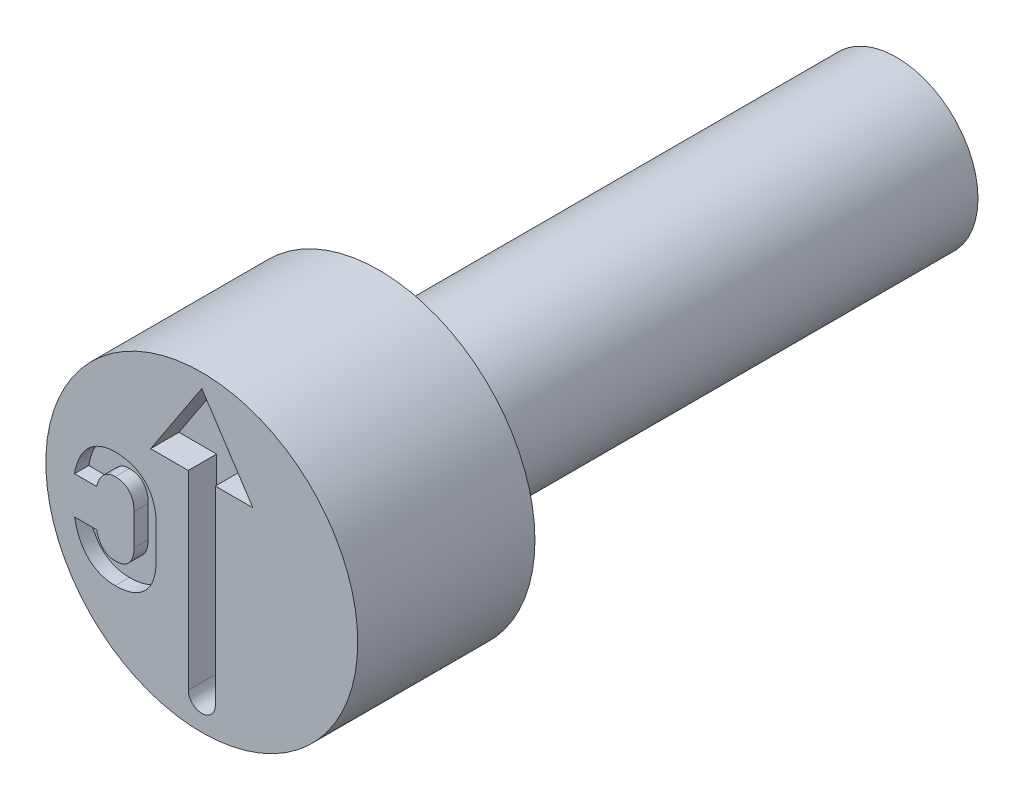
ISO-10303-21;
HEADER;
FILE_DESCRIPTION(('STEP AP214'),'2;1');
FILE_NAME('part.step','',(''),(''),'','','');
FILE_SCHEMA(('AUTOMOTIVE_DESIGN { 1 0 10303 214 1 1 1 1 }'));
ENDSEC;
DATA;
#1=APPLICATION_CONTEXT('core data for automotive mechanical design processes');
#2=APPLICATION_PROTOCOL_DEFINITION('international standard','automotive_design',2000,#1);
#3=PRODUCT_CONTEXT('',#1,'mechanical');
#4=PRODUCT('Part','Part','',(#3));
#5=PRODUCT_RELATED_PRODUCT_CATEGORY('part','',(#4));
#6=PRODUCT_DEFINITION_FORMATION('','',#4);
#7=PRODUCT_DEFINITION_CONTEXT('part definition',#1,'design');
#8=PRODUCT_DEFINITION('design','',#6,#7);
#9=PRODUCT_DEFINITION_SHAPE('','',#8);
#10=(LENGTH_UNIT() NAMED_UNIT(*) SI_UNIT(.MILLI.,.METRE.));
#11=(NAMED_UNIT(*) PLANE_ANGLE_UNIT() SI_UNIT($,.RADIAN.));
#12=(NAMED_UNIT(*) SI_UNIT($,.STERADIAN.) SOLID_ANGLE_UNIT());
#13=UNCERTAINTY_MEASURE_WITH_UNIT(LENGTH_MEASURE(1.E-05),#10,'distance_accuracy_value','');
#14=(GEOMETRIC_REPRESENTATION_CONTEXT(3) GLOBAL_UNCERTAINTY_ASSIGNED_CONTEXT((#13)) GLOBAL_UNIT_ASSIGNED_CONTEXT((#10,
#11,#12)) REPRESENTATION_CONTEXT('',''));
#15=CARTESIAN_POINT('',(0.,0.,0.));
#16=DIRECTION('',(0.,0.,1.));
#17=DIRECTION('',(1.,0.,0.));
#18=AXIS2_PLACEMENT_3D('',#15,#16,#17);
#19=CARTESIAN_POINT('',(0.,1.15,-2.5));
#20=DIRECTION('',(0.,0.,1.));
#21=DIRECTION('',(1.,0.,0.));
#22=AXIS2_PLACEMENT_3D('',#19,#20,#21);
#23=PLANE('',#22);
#24=CARTESIAN_POINT('',(0.,0.,-2.5));
#25=DIRECTION('',(0.,0.,1.));
#26=DIRECTION('',(1.,0.,0.));
#27=AXIS2_PLACEMENT_3D('',#24,#25,#26);
#28=CIRCLE('',#27,2.2);
#29=CARTESIAN_POINT('',(2.2,0.,-2.5));
#30=VERTEX_POINT('',#29);
#31=EDGE_CURVE('E11',#30,#30,#28,.T.);
#32=ORIENTED_EDGE('',*,*,#31,.F.);
#33=EDGE_LOOP('',(#32));
#34=FACE_BOUND('',#33,.T.);
#35=CARTESIAN_POINT('',(0.,0.,-2.5));
#36=DIRECTION('',(0.,0.,1.));
#37=DIRECTION('',(1.,0.,0.));
#38=AXIS2_PLACEMENT_3D('',#35,#36,#37);
#39=CIRCLE('',#38,1.15);
#40=CARTESIAN_POINT('',(1.15,0.,-2.5));
#41=VERTEX_POINT('',#40);
#42=EDGE_CURVE('E262',#41,#41,#39,.T.);
#43=ORIENTED_EDGE('',*,*,#42,.T.);
#44=EDGE_LOOP('',(#43));
#45=FACE_BOUND('',#44,.T.);
#46=ADVANCED_FACE('F34',(#34,#45),#23,.F.);
#47=CARTESIAN_POINT('',(0.,0.,-0.403888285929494));
#48=DIRECTION('',(0.,0.,1.));
#49=DIRECTION('',(1.,0.,0.));
#50=AXIS2_PLACEMENT_3D('',#47,#48,#49);
#51=CYLINDRICAL_SURFACE('',#50,2.2);
#52=CARTESIAN_POINT('',(0.,0.,0.));
#53=DIRECTION('',(0.,0.,1.));
#54=DIRECTION('',(1.,0.,0.));
#55=AXIS2_PLACEMENT_3D('',#52,#53,#54);
#56=CIRCLE('',#55,2.2);
#57=CARTESIAN_POINT('',(2.2,0.,0.));
#58=VERTEX_POINT('',#57);
#59=EDGE_CURVE('E41',#58,#58,#56,.T.);
#60=ORIENTED_EDGE('',*,*,#59,.F.);
#61=EDGE_LOOP('',(#60));
#62=FACE_BOUND('',#61,.T.);
#63=ORIENTED_EDGE('',*,*,#31,.T.);
#64=EDGE_LOOP('',(#63));
#65=FACE_BOUND('',#64,.T.);
#66=ADVANCED_FACE('F247',(#62,#65),#51,.T.);
#67=CARTESIAN_POINT('',(0.,2.2,0.));
#68=DIRECTION('',(0.,0.,-1.));
#69=DIRECTION('',(-1.,0.,0.));
#70=AXIS2_PLACEMENT_3D('',#67,#68,#69);
#71=PLANE('',#70);
#72=CARTESIAN_POINT('',(-1.22190747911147,-1.01662930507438,0.));
#73=CARTESIAN_POINT('',(-1.20701133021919,-1.01646817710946,0.));
#74=CARTESIAN_POINT('',(-1.17761661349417,-1.01615022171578,0.));
#75=CARTESIAN_POINT('',(-1.13439405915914,-1.01284183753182,0.));
#76=CARTESIAN_POINT('',(-1.09269488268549,-1.00731139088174,0.));
#77=CARTESIAN_POINT('',(-1.05274648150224,-0.999512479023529,0.));
#78=CARTESIAN_POINT('',(-1.01443850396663,-0.989673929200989,0.));
#79=CARTESIAN_POINT('',(-0.977606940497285,-0.978045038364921,0.));
#80=CARTESIAN_POINT('',(-0.942606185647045,-0.963648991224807,0.));
#81=CARTESIAN_POINT('',(-0.909096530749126,-0.947323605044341,0.));
#82=CARTESIAN_POINT('',(-0.877549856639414,-0.928845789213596,0.));
#83=CARTESIAN_POINT('',(-0.848033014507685,-0.908062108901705,0.));
#84=CARTESIAN_POINT('',(-0.820253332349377,-0.885624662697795,0.));
#85=CARTESIAN_POINT('',(-0.794421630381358,-0.861083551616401,0.));
#86=CARTESIAN_POINT('',(-0.770564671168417,-0.834582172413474,0.));
#87=CARTESIAN_POINT('',(-0.748546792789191,-0.806091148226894,0.));
#88=CARTESIAN_POINT('',(-0.72882046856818,-0.775428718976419,0.));
#89=CARTESIAN_POINT('',(-0.71077473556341,-0.743008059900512,0.));
#90=CARTESIAN_POINT('',(-0.694719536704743,-0.708740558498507,0.));
#91=CARTESIAN_POINT('',(-0.681168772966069,-0.6724626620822,0.));
#92=CARTESIAN_POINT('',(-0.669420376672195,-0.634574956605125,0.));
#93=CARTESIAN_POINT('',(-0.659592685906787,-0.595083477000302,0.));
#94=CARTESIAN_POINT('',(-0.652068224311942,-0.553808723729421,0.));
#95=CARTESIAN_POINT('',(-0.647052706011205,-0.510782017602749,0.));
#96=CARTESIAN_POINT('',(-0.643575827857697,-0.465962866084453,0.));
#97=CARTESIAN_POINT('',(-0.64328884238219,-0.435480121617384,0.));
#98=CARTESIAN_POINT('',(-0.64314244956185,-0.419930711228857,0.));
#99=B_SPLINE_CURVE_WITH_KNOTS('',3,(#72,#73,#74,#75,#76,#77,#78,#79,#80,#81,#82,#83,#84,#85,#86,
#87,#88,#89,#90,#91,#92,#93,#94,#95,#96,#97,#98),.UNSPECIFIED.,.F.,.F.,(4,1,1,1,1,1,1,1,1,1,1,1,
1,1,1,1,1,1,1,1,1,1,1,1,4),(0.,0.0472598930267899,0.0932584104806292,0.137448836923,
0.180669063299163,0.222325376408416,0.262898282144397,0.303117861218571,0.342294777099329,
0.381096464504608,0.418984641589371,0.456742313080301,0.494310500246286,0.531916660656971,
0.569787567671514,0.608434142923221,0.647492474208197,0.687453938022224,0.728384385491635,
0.770272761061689,0.813266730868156,0.85743965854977,0.903297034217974,0.950671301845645,1.),.UNSPECIFIED.);
#100=CARTESIAN_POINT('',(-1.22190747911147,-1.01662930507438,0.));
#101=VERTEX_POINT('',#100);
#102=CARTESIAN_POINT('',(-0.64314244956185,-0.419930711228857,0.));
#103=VERTEX_POINT('',#102);
#104=EDGE_CURVE('E400',#101,#103,#99,.T.);
#105=ORIENTED_EDGE('',*,*,#104,.F.);
#106=CARTESIAN_POINT('',(-1.79512940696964,-0.463949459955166,0.));
#107=CARTESIAN_POINT('',(-1.78955689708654,-0.492222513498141,0.));
#108=CARTESIAN_POINT('',(-1.77872292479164,-0.547190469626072,0.));
#109=CARTESIAN_POINT('',(-1.75437711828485,-0.625468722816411,0.));
#110=CARTESIAN_POINT('',(-1.72437511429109,-0.697389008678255,0.));
#111=CARTESIAN_POINT('',(-1.68867105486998,-0.762843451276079,0.));
#112=CARTESIAN_POINT('',(-1.64704727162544,-0.821184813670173,0.));
#113=CARTESIAN_POINT('',(-1.60049969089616,-0.872631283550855,0.));
#114=CARTESIAN_POINT('',(-1.54863495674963,-0.916748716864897,0.));
#115=CARTESIAN_POINT('',(-1.4915597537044,-0.953093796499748,0.));
#116=CARTESIAN_POINT('',(-1.42993190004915,-0.981666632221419,0.));
#117=CARTESIAN_POINT('',(-1.36408866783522,-1.00173265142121,0.));
#118=CARTESIAN_POINT('',(-1.29436936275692,-1.01471434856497,0.));
#119=CARTESIAN_POINT('',(-1.24642196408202,-1.01598145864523,0.));
#120=CARTESIAN_POINT('',(-1.22190747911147,-1.01662930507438,0.));
#121=B_SPLINE_CURVE_WITH_KNOTS('',3,(#106,#107,#108,#109,#110,#111,#112,#113,#114,#115,#116,
#117,#118,#119,#120),.UNSPECIFIED.,.F.,.F.,(4,1,1,1,1,1,1,1,1,1,1,1,4),(0.,0.098823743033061,
0.192131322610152,0.28071953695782,0.365844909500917,0.447392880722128,0.52606487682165,
0.603327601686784,0.680299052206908,0.757555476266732,0.835645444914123,0.915969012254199,1.),.UNSPECIFIED.);
#122=CARTESIAN_POINT('',(-1.79512940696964,-0.463949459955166,0.));
#123=VERTEX_POINT('',#122);
#124=EDGE_CURVE('E48',#123,#101,#121,.T.);
#125=ORIENTED_EDGE('',*,*,#124,.F.);
#126=DIRECTION('',(-1.,0.,0.));
#127=VECTOR('',#126,1.);
#128=CARTESIAN_POINT('',(-1.48275932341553,-0.463949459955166,0.));
#129=LINE('',#128,#127);
#130=CARTESIAN_POINT('',(-1.48275932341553,-0.463949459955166,0.));
#131=VERTEX_POINT('',#130);
#132=EDGE_CURVE('E185',#131,#123,#129,.T.);
#133=ORIENTED_EDGE('',*,*,#132,.F.);
#134=CARTESIAN_POINT('',(-1.22190747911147,-0.71501936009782,0.));
#135=CARTESIAN_POINT('',(-1.23268477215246,-0.714594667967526,0.));
#136=CARTESIAN_POINT('',(-1.25382321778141,-0.713761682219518,0.));
#137=CARTESIAN_POINT('',(-1.28470434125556,-0.708662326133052,0.));
#138=CARTESIAN_POINT('',(-1.31377990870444,-0.69926447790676,0.));
#139=CARTESIAN_POINT('',(-1.34124614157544,-0.686602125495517,0.));
#140=CARTESIAN_POINT('',(-1.3669017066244,-0.670242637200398,0.));
#141=CARTESIAN_POINT('',(-1.39001523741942,-0.650029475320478,0.));
#142=CARTESIAN_POINT('',(-1.41154413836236,-0.627020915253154,0.));
#143=CARTESIAN_POINT('',(-1.43070554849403,-0.600467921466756,0.));
#144=CARTESIAN_POINT('',(-1.44769139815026,-0.57075366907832,0.));
#145=CARTESIAN_POINT('',(-1.46189629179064,-0.537866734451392,0.));
#146=CARTESIAN_POINT('',(-1.4742266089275,-0.50217337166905,0.));
#147=CARTESIAN_POINT('',(-1.47985683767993,-0.476951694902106,0.));
#148=CARTESIAN_POINT('',(-1.48275932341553,-0.463949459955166,0.));
#149=B_SPLINE_CURVE_WITH_KNOTS('',3,(#134,#135,#136,#137,#138,#139,#140,#141,#142,#143,#144,
#145,#146,#147,#148),.UNSPECIFIED.,.F.,.F.,(4,1,1,1,1,1,1,1,1,1,1,1,4),(0.,0.081756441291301,
0.160356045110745,0.236478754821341,0.312819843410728,0.389192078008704,0.466352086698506,
0.545094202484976,0.627698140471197,0.714093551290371,0.80415108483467,0.899036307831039,1.),.UNSPECIFIED.);
#150=CARTESIAN_POINT('',(-1.22190747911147,-0.71501936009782,0.));
#151=VERTEX_POINT('',#150);
#152=EDGE_CURVE('E188',#151,#131,#149,.T.);
#153=ORIENTED_EDGE('',*,*,#152,.F.);
#154=CARTESIAN_POINT('',(-0.955512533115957,-0.419930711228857,0.));
#155=CARTESIAN_POINT('',(-0.955864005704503,-0.434949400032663,0.));
#156=CARTESIAN_POINT('',(-0.956544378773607,-0.464022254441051,0.));
#157=CARTESIAN_POINT('',(-0.962438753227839,-0.505906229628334,0.));
#158=CARTESIAN_POINT('',(-0.972190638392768,-0.544432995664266,0.));
#159=CARTESIAN_POINT('',(-0.985720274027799,-0.579536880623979,0.));
#160=CARTESIAN_POINT('',(-1.00349241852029,-0.610716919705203,0.));
#161=CARTESIAN_POINT('',(-1.0245981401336,-0.638224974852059,0.));
#162=CARTESIAN_POINT('',(-1.04915937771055,-0.661994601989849,0.));
#163=CARTESIAN_POINT('',(-1.07755737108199,-0.681334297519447,0.));
#164=CARTESIAN_POINT('',(-1.10923675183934,-0.696462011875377,0.));
#165=CARTESIAN_POINT('',(-1.14407628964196,-0.707095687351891,0.));
#166=CARTESIAN_POINT('',(-1.18198315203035,-0.713770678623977,0.));
#167=CARTESIAN_POINT('',(-1.20829234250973,-0.714593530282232,0.));
#168=CARTESIAN_POINT('',(-1.22190747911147,-0.71501936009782,0.));
#169=B_SPLINE_CURVE_WITH_KNOTS('',3,(#154,#155,#156,#157,#158,#159,#160,#161,#162,#163,#164,
#165,#166,#167,#168),.UNSPECIFIED.,.F.,.F.,(4,1,1,1,1,1,1,1,1,1,1,1,4),(0.,0.0997433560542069,
0.193081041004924,0.280299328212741,0.363302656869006,0.442209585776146,0.517891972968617,
0.592965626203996,0.668275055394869,0.745143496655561,0.825309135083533,0.909596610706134,1.),.UNSPECIFIED.);
#170=CARTESIAN_POINT('',(-0.955512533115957,-0.419930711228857,0.));
#171=VERTEX_POINT('',#170);
#172=EDGE_CURVE('E348',#171,#151,#169,.T.);
#173=ORIENTED_EDGE('',*,*,#172,.F.);
#174=DIRECTION('',(0.,-1.,0.));
#175=VECTOR('',#174,1.);
#176=CARTESIAN_POINT('',(-0.955512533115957,0.0189525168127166,0.));
#177=LINE('',#176,#175);
#178=CARTESIAN_POINT('',(-0.955512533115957,0.0189525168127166,0.));
#179=VERTEX_POINT('',#178);
#180=EDGE_CURVE('E356',#179,#171,#177,.T.);
#181=ORIENTED_EDGE('',*,*,#180,.F.);
#182=CARTESIAN_POINT('',(-1.22190747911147,0.31501936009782,0.));
#183=CARTESIAN_POINT('',(-1.20830249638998,0.31454307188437,0.));
#184=CARTESIAN_POINT('',(-1.18203109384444,0.313623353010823,0.));
#185=CARTESIAN_POINT('',(-1.14397224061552,0.307631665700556,0.));
#186=CARTESIAN_POINT('',(-1.10930483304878,0.296344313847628,0.));
#187=CARTESIAN_POINT('',(-1.07754469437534,0.28137049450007,0.));
#188=CARTESIAN_POINT('',(-1.04917297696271,0.261976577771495,0.));
#189=CARTESIAN_POINT('',(-1.02449379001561,0.238201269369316,0.));
#190=CARTESIAN_POINT('',(-1.00349467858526,0.210367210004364,0.));
#191=CARTESIAN_POINT('',(-0.985799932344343,0.178953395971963,0.));
#192=CARTESIAN_POINT('',(-0.972118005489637,0.143693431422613,0.));
#193=CARTESIAN_POINT('',(-0.96249121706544,0.105022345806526,0.));
#194=CARTESIAN_POINT('',(-0.95653393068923,0.06304689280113,0.));
#195=CARTESIAN_POINT('',(-0.955860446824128,0.0339721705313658,0.));
#196=CARTESIAN_POINT('',(-0.955512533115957,0.0189525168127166,0.));
#197=B_SPLINE_CURVE_WITH_KNOTS('',3,(#182,#183,#184,#185,#186,#187,#188,#189,#190,#191,#192,
#193,#194,#195,#196),.UNSPECIFIED.,.F.,.F.,(4,1,1,1,1,1,1,1,1,1,1,1,4),(0.,0.0902231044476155,
0.174222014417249,0.25444494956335,0.331160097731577,0.406319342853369,0.481243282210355,
0.557346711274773,0.636723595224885,0.719561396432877,0.807304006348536,0.900455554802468,1.),.UNSPECIFIED.);
#198=CARTESIAN_POINT('',(-1.22190747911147,0.31501936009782,0.));
#199=VERTEX_POINT('',#198);
#200=EDGE_CURVE('E362',#199,#179,#197,.T.);
#201=ORIENTED_EDGE('',*,*,#200,.F.);
#202=CARTESIAN_POINT('',(-1.48275932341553,0.0642755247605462,0.));
#203=CARTESIAN_POINT('',(-1.47960849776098,0.07705628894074,0.));
#204=CARTESIAN_POINT('',(-1.47347727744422,0.10192649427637,0.));
#205=CARTESIAN_POINT('',(-1.46085353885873,0.137306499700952,0.));
#206=CARTESIAN_POINT('',(-1.44649908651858,0.170077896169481,0.));
#207=CARTESIAN_POINT('',(-1.42894362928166,0.199459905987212,0.));
#208=CARTESIAN_POINT('',(-1.409832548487,0.226161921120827,0.));
#209=CARTESIAN_POINT('',(-1.3882796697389,0.249295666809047,0.));
#210=CARTESIAN_POINT('',(-1.36475673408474,0.269244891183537,0.));
#211=CARTESIAN_POINT('',(-1.33944537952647,0.285744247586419,0.));
#212=CARTESIAN_POINT('',(-1.31241453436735,0.299190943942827,0.));
#213=CARTESIAN_POINT('',(-1.28354117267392,0.308090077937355,0.));
#214=CARTESIAN_POINT('',(-1.25322389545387,0.313901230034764,0.));
#215=CARTESIAN_POINT('',(-1.23247781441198,0.314641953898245,0.));
#216=CARTESIAN_POINT('',(-1.22190747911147,0.31501936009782,0.));
#217=B_SPLINE_CURVE_WITH_KNOTS('',3,(#202,#203,#204,#205,#206,#207,#208,#209,#210,#211,#212,
#213,#214,#215,#216),.UNSPECIFIED.,.F.,.F.,(4,1,1,1,1,1,1,1,1,1,1,1,4),(0.,0.100258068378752,
0.195093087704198,0.285925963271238,0.37244127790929,0.455447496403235,0.535743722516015,
0.612742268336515,0.689936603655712,0.765509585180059,0.842003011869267,0.919498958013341,1.),.UNSPECIFIED.);
#218=CARTESIAN_POINT('',(-1.48275932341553,0.0642755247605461,0.));
#219=VERTEX_POINT('',#218);
#220=EDGE_CURVE('E367',#219,#199,#217,.T.);
#221=ORIENTED_EDGE('',*,*,#220,.F.);
#222=DIRECTION('',(1.,0.,0.));
#223=VECTOR('',#222,1.);
#224=CARTESIAN_POINT('',(-1.79512940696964,0.0642755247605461,0.));
#225=LINE('',#224,#223);
#226=CARTESIAN_POINT('',(-1.79512940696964,0.0642755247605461,0.));
#227=VERTEX_POINT('',#226);
#228=EDGE_CURVE('E375',#227,#219,#225,.T.);
#229=ORIENTED_EDGE('',*,*,#228,.F.);
#230=CARTESIAN_POINT('',(-1.22190747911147,0.616629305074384,0.));
#231=CARTESIAN_POINT('',(-1.24642073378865,0.615973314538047,0.));
#232=CARTESIAN_POINT('',(-1.29447282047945,0.614687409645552,0.));
#233=CARTESIAN_POINT('',(-1.36431278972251,0.601776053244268,0.));
#234=CARTESIAN_POINT('',(-1.43026454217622,0.581674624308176,0.));
#235=CARTESIAN_POINT('',(-1.4919426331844,0.553011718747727,0.));
#236=CARTESIAN_POINT('',(-1.54915397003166,0.516847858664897,0.));
#237=CARTESIAN_POINT('',(-1.60122874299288,0.472847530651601,0.));
#238=CARTESIAN_POINT('',(-1.64814943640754,0.42158694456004,0.));
#239=CARTESIAN_POINT('',(-1.68951103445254,0.362856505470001,0.));
#240=CARTESIAN_POINT('',(-1.72543135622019,0.297475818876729,0.));
#241=CARTESIAN_POINT('',(-1.75500233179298,0.225436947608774,0.));
#242=CARTESIAN_POINT('',(-1.77900519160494,0.147276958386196,0.));
#243=CARTESIAN_POINT('',(-1.78965859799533,0.0924372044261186,0.));
#244=CARTESIAN_POINT('',(-1.79512940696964,0.0642755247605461,0.));
#245=B_SPLINE_CURVE_WITH_KNOTS('',3,(#230,#231,#232,#233,#234,#235,#236,#237,#238,#239,#240,
#241,#242,#243,#244),.UNSPECIFIED.,.F.,.F.,(4,1,1,1,1,1,1,1,1,1,1,1,4),(0.,0.0840057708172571,
0.164672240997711,0.242738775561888,0.319972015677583,0.397234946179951,0.474233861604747,
0.553133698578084,0.634960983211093,0.720060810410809,0.808478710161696,0.901648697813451,1.),.UNSPECIFIED.);
#246=CARTESIAN_POINT('',(-1.22190747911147,0.616629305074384,0.));
#247=VERTEX_POINT('',#246);
#248=EDGE_CURVE('E381',#247,#227,#245,.T.);
#249=ORIENTED_EDGE('',*,*,#248,.F.);
#250=CARTESIAN_POINT('',(-0.64314244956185,0.0189525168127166,0.));
#251=CARTESIAN_POINT('',(-0.643288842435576,0.0345019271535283,0.));
#252=CARTESIAN_POINT('',(-0.643575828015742,0.0649846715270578,0.));
#253=CARTESIAN_POINT('',(-0.647052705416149,0.109803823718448,0.));
#254=CARTESIAN_POINT('',(-0.652068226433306,0.152830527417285,0.));
#255=CARTESIAN_POINT('',(-0.659592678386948,0.19410528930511,0.));
#256=CARTESIAN_POINT('',(-0.669420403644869,0.233596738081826,0.));
#257=CARTESIAN_POINT('',(-0.681168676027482,0.271484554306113,0.));
#258=CARTESIAN_POINT('',(-0.694719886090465,0.307762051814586,0.));
#259=CARTESIAN_POINT('',(-0.710773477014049,0.342030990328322,0.));
#260=CARTESIAN_POINT('',(-0.728825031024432,0.374446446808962,0.));
#261=CARTESIAN_POINT('',(-0.748530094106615,0.40512787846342,0.));
#262=CARTESIAN_POINT('',(-0.770675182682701,0.433613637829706,0.));
#263=CARTESIAN_POINT('',(-0.794305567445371,0.460426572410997,0.));
#264=CARTESIAN_POINT('',(-0.820267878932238,0.484960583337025,0.));
#265=CARTESIAN_POINT('',(-0.848032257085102,0.507406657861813,0.));
#266=CARTESIAN_POINT('',(-0.877538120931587,0.528219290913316,0.));
#267=CARTESIAN_POINT('',(-0.909187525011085,0.546593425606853,0.));
#268=CARTESIAN_POINT('',(-0.942504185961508,0.563429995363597,0.));
#269=CARTESIAN_POINT('',(-0.977686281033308,0.577597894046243,0.));
#270=CARTESIAN_POINT('',(-1.01436628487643,0.589783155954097,0.));
#271=CARTESIAN_POINT('',(-1.05275763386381,0.599479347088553,0.));
#272=CARTESIAN_POINT('',(-1.09269177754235,0.607320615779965,0.));
#273=CARTESIAN_POINT('',(-1.13439493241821,0.612839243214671,0.));
#274=CARTESIAN_POINT('',(-1.17761638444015,0.616150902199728,0.));
#275=CARTESIAN_POINT('',(-1.20701125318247,0.616468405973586,0.));
#276=CARTESIAN_POINT('',(-1.22190747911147,0.616629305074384,0.));
#277=B_SPLINE_CURVE_WITH_KNOTS('',3,(#250,#251,#252,#253,#254,#255,#256,#257,#258,#259,#260,
#261,#262,#263,#264,#265,#266,#267,#268,#269,#270,#271,#272,#273,#274,#275,#276),.UNSPECIFIED.,
.F.,.F.,(4,1,1,1,1,1,1,1,1,1,1,1,1,1,1,1,1,1,1,1,1,1,1,1,4),(0.,0.049303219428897,
0.0966530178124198,0.142486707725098,0.186636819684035,0.229608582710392,0.271475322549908,
0.312384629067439,0.352325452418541,0.391363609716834,0.429990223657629,0.467841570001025,
0.505685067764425,0.543233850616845,0.580972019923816,0.618840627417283,0.657622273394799,
0.696931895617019,0.737130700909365,0.777789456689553,0.819424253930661,0.862622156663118,
0.906789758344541,0.952764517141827,1.),.UNSPECIFIED.);
#278=CARTESIAN_POINT('',(-0.64314244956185,0.0189525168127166,0.));
#279=VERTEX_POINT('',#278);
#280=EDGE_CURVE('E386',#279,#247,#277,.T.);
#281=ORIENTED_EDGE('',*,*,#280,.F.);
#282=DIRECTION('',(0.,1.,0.));
#283=VECTOR('',#282,1.);
#284=CARTESIAN_POINT('',(-0.64314244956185,-0.419930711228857,0.));
#285=LINE('',#284,#283);
#286=EDGE_CURVE('E394',#103,#279,#285,.T.);
#287=ORIENTED_EDGE('',*,*,#286,.F.);
#288=EDGE_LOOP('',(#105,#125,#133,#153,#173,#181,#201,#221,#229,#249,#281,#287));
#289=FACE_BOUND('',#288,.T.);
#290=DIRECTION('',(0.,1.,0.));
#291=VECTOR('',#290,1.);
#292=CARTESIAN_POINT('',(0.190473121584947,0.906351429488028,0.));
#293=LINE('',#292,#291);
#294=CARTESIAN_POINT('',(0.190473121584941,-1.77616183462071,0.));
#295=VERTEX_POINT('',#294);
#296=CARTESIAN_POINT('',(0.190473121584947,0.906351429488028,0.));
#297=VERTEX_POINT('',#296);
#298=EDGE_CURVE('E300',#295,#297,#293,.T.);
#299=ORIENTED_EDGE('',*,*,#298,.F.);
#300=CARTESIAN_POINT('',(1.6342449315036E-13,-1.77616183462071,0.));
#301=DIRECTION('',(0.,0.,1.));
#302=DIRECTION('',(1.,0.,0.));
#303=AXIS2_PLACEMENT_3D('',#300,#301,#302);
#304=CIRCLE('',#303,0.190473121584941);
#305=CARTESIAN_POINT('',(-0.190473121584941,-1.77616183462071,0.));
#306=VERTEX_POINT('',#305);
#307=EDGE_CURVE('E56',#306,#295,#304,.T.);
#308=ORIENTED_EDGE('',*,*,#307,.F.);
#309=DIRECTION('',(0.,-1.,0.));
#310=VECTOR('',#309,1.);
#311=CARTESIAN_POINT('',(-0.190473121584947,0.906351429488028,0.));
#312=LINE('',#311,#310);
#313=CARTESIAN_POINT('',(-0.190473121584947,0.906351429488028,0.));
#314=VERTEX_POINT('',#313);
#315=EDGE_CURVE('E284',#314,#306,#312,.T.);
#316=ORIENTED_EDGE('',*,*,#315,.F.);
#317=DIRECTION('',(1.,0.,0.));
#318=VECTOR('',#317,1.);
#319=CARTESIAN_POINT('',(-0.721917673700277,0.906351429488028,0.));
#320=LINE('',#319,#318);
#321=CARTESIAN_POINT('',(-0.721917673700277,0.906351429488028,0.));
#322=VERTEX_POINT('',#321);
#323=EDGE_CURVE('E288',#322,#314,#320,.T.);
#324=ORIENTED_EDGE('',*,*,#323,.F.);
#325=DIRECTION('',(-0.550159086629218,-0.835059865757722,0.));
#326=VECTOR('',#325,1.);
#327=CARTESIAN_POINT('',(0.,2.00211534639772,0.));
#328=LINE('',#327,#326);
#329=CARTESIAN_POINT('',(0.,2.00211534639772,0.));
#330=VERTEX_POINT('',#329);
#331=EDGE_CURVE('E291',#330,#322,#328,.T.);
#332=ORIENTED_EDGE('',*,*,#331,.F.);
#333=DIRECTION('',(-0.550159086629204,0.835059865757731,0.));
#334=VECTOR('',#333,1.);
#335=CARTESIAN_POINT('',(0.,2.00211534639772,0.));
#336=LINE('',#335,#334);
#337=CARTESIAN_POINT('',(0.721917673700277,0.906351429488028,0.));
#338=VERTEX_POINT('',#337);
#339=EDGE_CURVE('E294',#338,#330,#336,.T.);
#340=ORIENTED_EDGE('',*,*,#339,.F.);
#341=DIRECTION('',(1.,0.,0.));
#342=VECTOR('',#341,1.);
#343=CARTESIAN_POINT('',(0.721917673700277,0.906351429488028,0.));
#344=LINE('',#343,#342);
#345=EDGE_CURVE('E297',#297,#338,#344,.T.);
#346=ORIENTED_EDGE('',*,*,#345,.F.);
#347=EDGE_LOOP('',(#299,#308,#316,#324,#332,#340,#346));
#348=FACE_BOUND('',#347,.T.);
#349=ORIENTED_EDGE('',*,*,#59,.T.);
#350=EDGE_LOOP('',(#349));
#351=FACE_BOUND('',#350,.T.);
#352=ADVANCED_FACE('F244',(#289,#348,#351),#71,.F.);
#353=CARTESIAN_POINT('',(0.,0.,-9.8));
#354=DIRECTION('',(0.,0.,1.));
#355=DIRECTION('',(1.,0.,0.));
#356=AXIS2_PLACEMENT_3D('',#353,#354,#355);
#357=PLANE('',#356);
#358=CARTESIAN_POINT('',(0.,0.,-9.8));
#359=DIRECTION('',(0.,0.,1.));
#360=DIRECTION('',(1.,0.,0.));
#361=AXIS2_PLACEMENT_3D('',#358,#359,#360);
#362=CIRCLE('',#361,1.15);
#363=CARTESIAN_POINT('',(1.15,0.,-9.8));
#364=VERTEX_POINT('',#363);
#365=EDGE_CURVE('E263',#364,#364,#362,.T.);
#366=ORIENTED_EDGE('',*,*,#365,.F.);
#367=EDGE_LOOP('',(#366));
#368=FACE_BOUND('',#367,.T.);
#369=ADVANCED_FACE('F240',(#368),#357,.F.);
#370=CARTESIAN_POINT('',(0.,0.,-0.403888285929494));
#371=DIRECTION('',(0.,0.,1.));
#372=DIRECTION('',(1.,0.,0.));
#373=AXIS2_PLACEMENT_3D('',#370,#371,#372);
#374=CYLINDRICAL_SURFACE('',#373,1.15);
#375=ORIENTED_EDGE('',*,*,#42,.F.);
#376=EDGE_LOOP('',(#375));
#377=FACE_BOUND('',#376,.T.);
#378=ORIENTED_EDGE('',*,*,#365,.T.);
#379=EDGE_LOOP('',(#378));
#380=FACE_BOUND('',#379,.T.);
#381=ADVANCED_FACE('F237',(#377,#380),#374,.T.);
#382=CARTESIAN_POINT('',(1.6342449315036E-13,-1.77616183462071,-0.4));
#383=DIRECTION('',(0.,0.,1.));
#384=DIRECTION('',(1.,0.,0.));
#385=AXIS2_PLACEMENT_3D('',#382,#383,#384);
#386=CYLINDRICAL_SURFACE('',#385,0.190473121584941);
#387=ORIENTED_EDGE('',*,*,#307,.T.);
#388=DIRECTION('',(0.,0.,1.));
#389=VECTOR('',#388,1.);
#390=CARTESIAN_POINT('',(0.190473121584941,-1.77616183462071,-0.4));
#391=LINE('',#390,#389);
#392=CARTESIAN_POINT('',(0.190473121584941,-1.77616183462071,-0.4));
#393=VERTEX_POINT('',#392);
#394=EDGE_CURVE('E271',#393,#295,#391,.T.);
#395=ORIENTED_EDGE('',*,*,#394,.F.);
#396=CARTESIAN_POINT('',(1.6342449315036E-13,-1.77616183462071,-0.4));
#397=DIRECTION('',(0.,0.,1.));
#398=DIRECTION('',(1.,0.,0.));
#399=AXIS2_PLACEMENT_3D('',#396,#397,#398);
#400=CIRCLE('',#399,0.190473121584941);
#401=CARTESIAN_POINT('',(-0.190473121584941,-1.77616183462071,-0.4));
#402=VERTEX_POINT('',#401);
#403=EDGE_CURVE('E287',#402,#393,#400,.T.);
#404=ORIENTED_EDGE('',*,*,#403,.F.);
#405=DIRECTION('',(0.,0.,1.));
#406=VECTOR('',#405,1.);
#407=CARTESIAN_POINT('',(-0.190473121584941,-1.77616183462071,-0.4));
#408=LINE('',#407,#406);
#409=EDGE_CURVE('E264',#402,#306,#408,.T.);
#410=ORIENTED_EDGE('',*,*,#409,.T.);
#411=EDGE_LOOP('',(#387,#395,#404,#410));
#412=FACE_BOUND('',#411,.T.);
#413=ADVANCED_FACE('F215',(#412),#386,.F.);
#414=CARTESIAN_POINT('',(-0.190473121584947,0.906351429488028,-0.4));
#415=DIRECTION('',(-1.,0.,0.));
#416=DIRECTION('',(0.,-1.,0.));
#417=AXIS2_PLACEMENT_3D('',#414,#415,#416);
#418=PLANE('',#417);
#419=ORIENTED_EDGE('',*,*,#315,.T.);
#420=ORIENTED_EDGE('',*,*,#409,.F.);
#421=DIRECTION('',(0.,-1.,0.));
#422=VECTOR('',#421,1.);
#423=CARTESIAN_POINT('',(-0.190473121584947,0.906351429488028,-0.4));
#424=LINE('',#423,#422);
#425=CARTESIAN_POINT('',(-0.190473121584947,0.906351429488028,-0.4));
#426=VERTEX_POINT('',#425);
#427=EDGE_CURVE('E275',#426,#402,#424,.T.);
#428=ORIENTED_EDGE('',*,*,#427,.F.);
#429=DIRECTION('',(0.,0.,1.));
#430=VECTOR('',#429,1.);
#431=CARTESIAN_POINT('',(-0.190473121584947,0.906351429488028,-0.4));
#432=LINE('',#431,#430);
#433=EDGE_CURVE('E268',#426,#314,#432,.T.);
#434=ORIENTED_EDGE('',*,*,#433,.T.);
#435=EDGE_LOOP('',(#419,#420,#428,#434));
#436=FACE_BOUND('',#435,.T.);
#437=ADVANCED_FACE('F211',(#436),#418,.F.);
#438=CARTESIAN_POINT('',(-0.721917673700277,0.906351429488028,-0.4));
#439=DIRECTION('',(0.,-1.,0.));
#440=DIRECTION('',(0.,0.,-1.));
#441=AXIS2_PLACEMENT_3D('',#438,#439,#440);
#442=PLANE('',#441);
#443=ORIENTED_EDGE('',*,*,#323,.T.);
#444=ORIENTED_EDGE('',*,*,#433,.F.);
#445=DIRECTION('',(1.,0.,0.));
#446=VECTOR('',#445,1.);
#447=CARTESIAN_POINT('',(-0.721917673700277,0.906351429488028,-0.4));
#448=LINE('',#447,#446);
#449=CARTESIAN_POINT('',(-0.721917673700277,0.906351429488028,-0.4));
#450=VERTEX_POINT('',#449);
#451=EDGE_CURVE('E307',#450,#426,#448,.T.);
#452=ORIENTED_EDGE('',*,*,#451,.F.);
#453=DIRECTION('',(0.,0.,1.));
#454=VECTOR('',#453,1.);
#455=CARTESIAN_POINT('',(-0.721917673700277,0.906351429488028,-0.4));
#456=LINE('',#455,#454);
#457=EDGE_CURVE('E281',#450,#322,#456,.T.);
#458=ORIENTED_EDGE('',*,*,#457,.T.);
#459=EDGE_LOOP('',(#443,#444,#452,#458));
#460=FACE_BOUND('',#459,.T.);
#461=ADVANCED_FACE('F214',(#460),#442,.F.);
#462=CARTESIAN_POINT('',(0.,2.00211534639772,-0.4));
#463=DIRECTION('',(-0.835059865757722,0.550159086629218,0.));
#464=DIRECTION('',(-0.550159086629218,-0.835059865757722,0.));
#465=AXIS2_PLACEMENT_3D('',#462,#463,#464);
#466=PLANE('',#465);
#467=ORIENTED_EDGE('',*,*,#331,.T.);
#468=ORIENTED_EDGE('',*,*,#457,.F.);
#469=DIRECTION('',(-0.550159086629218,-0.835059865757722,0.));
#470=VECTOR('',#469,1.);
#471=CARTESIAN_POINT('',(0.,2.00211534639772,-0.4));
#472=LINE('',#471,#470);
#473=CARTESIAN_POINT('',(0.,2.00211534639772,-0.4));
#474=VERTEX_POINT('',#473);
#475=EDGE_CURVE('E310',#474,#450,#472,.T.);
#476=ORIENTED_EDGE('',*,*,#475,.F.);
#477=DIRECTION('',(0.,0.,1.));
#478=VECTOR('',#477,1.);
#479=CARTESIAN_POINT('',(0.,2.00211534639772,-0.4));
#480=LINE('',#479,#478);
#481=EDGE_CURVE('E279',#474,#330,#480,.T.);
#482=ORIENTED_EDGE('',*,*,#481,.T.);
#483=EDGE_LOOP('',(#467,#468,#476,#482));
#484=FACE_BOUND('',#483,.T.);
#485=ADVANCED_FACE('F219',(#484),#466,.F.);
#486=CARTESIAN_POINT('',(0.,2.00211534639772,-0.4));
#487=DIRECTION('',(0.835059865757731,0.550159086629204,0.));
#488=DIRECTION('',(-0.550159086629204,0.835059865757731,0.));
#489=AXIS2_PLACEMENT_3D('',#486,#487,#488);
#490=PLANE('',#489);
#491=ORIENTED_EDGE('',*,*,#339,.T.);
#492=ORIENTED_EDGE('',*,*,#481,.F.);
#493=DIRECTION('',(-0.550159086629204,0.835059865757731,0.));
#494=VECTOR('',#493,1.);
#495=CARTESIAN_POINT('',(0.,2.00211534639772,-0.4));
#496=LINE('',#495,#494);
#497=CARTESIAN_POINT('',(0.721917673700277,0.906351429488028,-0.4));
#498=VERTEX_POINT('',#497);
#499=EDGE_CURVE('E313',#498,#474,#496,.T.);
#500=ORIENTED_EDGE('',*,*,#499,.F.);
#501=DIRECTION('',(0.,0.,1.));
#502=VECTOR('',#501,1.);
#503=CARTESIAN_POINT('',(0.721917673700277,0.906351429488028,-0.4));
#504=LINE('',#503,#502);
#505=EDGE_CURVE('E277',#498,#338,#504,.T.);
#506=ORIENTED_EDGE('',*,*,#505,.T.);
#507=EDGE_LOOP('',(#491,#492,#500,#506));
#508=FACE_BOUND('',#507,.T.);
#509=ADVANCED_FACE('F223',(#508),#490,.F.);
#510=CARTESIAN_POINT('',(0.721917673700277,0.906351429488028,-0.4));
#511=DIRECTION('',(0.,-1.,0.));
#512=DIRECTION('',(0.,0.,-1.));
#513=AXIS2_PLACEMENT_3D('',#510,#511,#512);
#514=PLANE('',#513);
#515=ORIENTED_EDGE('',*,*,#345,.T.);
#516=ORIENTED_EDGE('',*,*,#505,.F.);
#517=DIRECTION('',(1.,0.,0.));
#518=VECTOR('',#517,1.);
#519=CARTESIAN_POINT('',(0.721917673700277,0.906351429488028,-0.4));
#520=LINE('',#519,#518);
#521=CARTESIAN_POINT('',(0.190473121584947,0.906351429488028,-0.4));
#522=VERTEX_POINT('',#521);
#523=EDGE_CURVE('E316',#522,#498,#520,.T.);
#524=ORIENTED_EDGE('',*,*,#523,.F.);
#525=DIRECTION('',(0.,0.,1.));
#526=VECTOR('',#525,1.);
#527=CARTESIAN_POINT('',(0.190473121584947,0.906351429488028,-0.4));
#528=LINE('',#527,#526);
#529=EDGE_CURVE('E274',#522,#297,#528,.T.);
#530=ORIENTED_EDGE('',*,*,#529,.T.);
#531=EDGE_LOOP('',(#515,#516,#524,#530));
#532=FACE_BOUND('',#531,.T.);
#533=ADVANCED_FACE('F227',(#532),#514,.F.);
#534=CARTESIAN_POINT('',(0.190473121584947,0.906351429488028,-0.4));
#535=DIRECTION('',(1.,0.,0.));
#536=DIRECTION('',(0.,1.,0.));
#537=AXIS2_PLACEMENT_3D('',#534,#535,#536);
#538=PLANE('',#537);
#539=ORIENTED_EDGE('',*,*,#298,.T.);
#540=ORIENTED_EDGE('',*,*,#529,.F.);
#541=DIRECTION('',(0.,1.,0.));
#542=VECTOR('',#541,1.);
#543=CARTESIAN_POINT('',(0.190473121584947,0.906351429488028,-0.4));
#544=LINE('',#543,#542);
#545=EDGE_CURVE('E319',#393,#522,#544,.T.);
#546=ORIENTED_EDGE('',*,*,#545,.F.);
#547=ORIENTED_EDGE('',*,*,#394,.T.);
#548=EDGE_LOOP('',(#539,#540,#546,#547));
#549=FACE_BOUND('',#548,.T.);
#550=ADVANCED_FACE('F209',(#549),#538,.F.);
#551=CARTESIAN_POINT('',(1.6342449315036E-13,-1.77616183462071,-0.4));
#552=DIRECTION('',(0.,0.,1.));
#553=DIRECTION('',(1.,0.,0.));
#554=AXIS2_PLACEMENT_3D('',#551,#552,#553);
#555=PLANE('',#554);
#556=ORIENTED_EDGE('',*,*,#403,.T.);
#557=ORIENTED_EDGE('',*,*,#545,.T.);
#558=ORIENTED_EDGE('',*,*,#523,.T.);
#559=ORIENTED_EDGE('',*,*,#499,.T.);
#560=ORIENTED_EDGE('',*,*,#475,.T.);
#561=ORIENTED_EDGE('',*,*,#451,.T.);
#562=ORIENTED_EDGE('',*,*,#427,.T.);
#563=EDGE_LOOP('',(#556,#557,#558,#559,#560,#561,#562));
#564=FACE_BOUND('',#563,.T.);
#565=ADVANCED_FACE('F205',(#564),#555,.T.);
#566=CARTESIAN_POINT('',(-1.79512940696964,-0.463949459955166,-0.2));
#567=CARTESIAN_POINT('',(-1.78955689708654,-0.492222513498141,-0.2));
#568=CARTESIAN_POINT('',(-1.77872292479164,-0.547190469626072,-0.2));
#569=CARTESIAN_POINT('',(-1.75437711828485,-0.625468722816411,-0.2));
#570=CARTESIAN_POINT('',(-1.72437511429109,-0.697389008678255,-0.2));
#571=CARTESIAN_POINT('',(-1.68867105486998,-0.762843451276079,-0.2));
#572=CARTESIAN_POINT('',(-1.64704727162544,-0.821184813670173,-0.2));
#573=CARTESIAN_POINT('',(-1.60049969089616,-0.872631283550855,-0.2));
#574=CARTESIAN_POINT('',(-1.54863495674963,-0.916748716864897,-0.2));
#575=CARTESIAN_POINT('',(-1.4915597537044,-0.953093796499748,-0.2));
#576=CARTESIAN_POINT('',(-1.42993190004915,-0.981666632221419,-0.2));
#577=CARTESIAN_POINT('',(-1.36408866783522,-1.00173265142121,-0.2));
#578=CARTESIAN_POINT('',(-1.29436936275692,-1.01471434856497,-0.2));
#579=CARTESIAN_POINT('',(-1.24642196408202,-1.01598145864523,-0.2));
#580=CARTESIAN_POINT('',(-1.22190747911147,-1.01662930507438,-0.2));
#581=B_SPLINE_CURVE_WITH_KNOTS('',3,(#566,#567,#568,#569,#570,#571,#572,#573,#574,#575,#576,
#577,#578,#579,#580),.UNSPECIFIED.,.F.,.F.,(4,1,1,1,1,1,1,1,1,1,1,1,4),(0.,0.098823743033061,
0.192131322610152,0.28071953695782,0.365844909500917,0.447392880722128,0.52606487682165,
0.603327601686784,0.680299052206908,0.757555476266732,0.835645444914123,0.915969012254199,1.),.UNSPECIFIED.);
#582=DIRECTION('',(0.,0.,1.));
#583=VECTOR('',#582,1.);
#584=SURFACE_OF_LINEAR_EXTRUSION('',#581,#583);
#585=ORIENTED_EDGE('',*,*,#124,.T.);
#586=DIRECTION('',(0.,0.,1.));
#587=VECTOR('',#586,1.);
#588=CARTESIAN_POINT('',(-1.22190747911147,-1.01662930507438,-0.2));
#589=LINE('',#588,#587);
#590=CARTESIAN_POINT('',(-1.22190747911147,-1.01662930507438,-0.2));
#591=VERTEX_POINT('',#590);
#592=EDGE_CURVE('E162',#591,#101,#589,.T.);
#593=ORIENTED_EDGE('',*,*,#592,.F.);
#594=CARTESIAN_POINT('',(-1.79512940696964,-0.463949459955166,-0.2));
#595=VERTEX_POINT('',#594);
#596=EDGE_CURVE('E166',#595,#591,#581,.T.);
#597=ORIENTED_EDGE('',*,*,#596,.F.);
#598=DIRECTION('',(0.,0.,1.));
#599=VECTOR('',#598,1.);
#600=CARTESIAN_POINT('',(-1.79512940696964,-0.463949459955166,-0.2));
#601=LINE('',#600,#599);
#602=EDGE_CURVE('E304',#595,#123,#601,.T.);
#603=ORIENTED_EDGE('',*,*,#602,.T.);
#604=EDGE_LOOP('',(#585,#593,#597,#603));
#605=FACE_BOUND('',#604,.T.);
#606=ADVANCED_FACE('F164',(#605),#584,.F.);
#607=CARTESIAN_POINT('',(-1.48275932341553,-0.463949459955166,-0.2));
#608=DIRECTION('',(0.,1.,0.));
#609=DIRECTION('',(0.,0.,1.));
#610=AXIS2_PLACEMENT_3D('',#607,#608,#609);
#611=PLANE('',#610);
#612=ORIENTED_EDGE('',*,*,#132,.T.);
#613=ORIENTED_EDGE('',*,*,#602,.F.);
#614=DIRECTION('',(-1.,0.,0.));
#615=VECTOR('',#614,1.);
#616=CARTESIAN_POINT('',(-1.48275932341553,-0.463949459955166,-0.2));
#617=LINE('',#616,#615);
#618=CARTESIAN_POINT('',(-1.48275932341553,-0.463949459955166,-0.2));
#619=VERTEX_POINT('',#618);
#620=EDGE_CURVE('E172',#619,#595,#617,.T.);
#621=ORIENTED_EDGE('',*,*,#620,.F.);
#622=DIRECTION('',(0.,0.,1.));
#623=VECTOR('',#622,1.);
#624=CARTESIAN_POINT('',(-1.48275932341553,-0.463949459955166,-0.2));
#625=LINE('',#624,#623);
#626=EDGE_CURVE('E341',#619,#131,#625,.T.);
#627=ORIENTED_EDGE('',*,*,#626,.T.);
#628=EDGE_LOOP('',(#612,#613,#621,#627));
#629=FACE_BOUND('',#628,.T.);
#630=ADVANCED_FACE('F204',(#629),#611,.F.);
#631=CARTESIAN_POINT('',(-1.22190747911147,-0.71501936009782,-0.2));
#632=CARTESIAN_POINT('',(-1.23268477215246,-0.714594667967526,-0.2));
#633=CARTESIAN_POINT('',(-1.25382321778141,-0.713761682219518,-0.2));
#634=CARTESIAN_POINT('',(-1.28470434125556,-0.708662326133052,-0.2));
#635=CARTESIAN_POINT('',(-1.31377990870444,-0.69926447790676,-0.2));
#636=CARTESIAN_POINT('',(-1.34124614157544,-0.686602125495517,-0.2));
#637=CARTESIAN_POINT('',(-1.3669017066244,-0.670242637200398,-0.2));
#638=CARTESIAN_POINT('',(-1.39001523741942,-0.650029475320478,-0.2));
#639=CARTESIAN_POINT('',(-1.41154413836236,-0.627020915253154,-0.2));
#640=CARTESIAN_POINT('',(-1.43070554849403,-0.600467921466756,-0.2));
#641=CARTESIAN_POINT('',(-1.44769139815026,-0.57075366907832,-0.2));
#642=CARTESIAN_POINT('',(-1.46189629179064,-0.537866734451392,-0.2));
#643=CARTESIAN_POINT('',(-1.4742266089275,-0.50217337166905,-0.2));
#644=CARTESIAN_POINT('',(-1.47985683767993,-0.476951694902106,-0.2));
#645=CARTESIAN_POINT('',(-1.48275932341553,-0.463949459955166,-0.2));
#646=B_SPLINE_CURVE_WITH_KNOTS('',3,(#631,#632,#633,#634,#635,#636,#637,#638,#639,#640,#641,
#642,#643,#644,#645),.UNSPECIFIED.,.F.,.F.,(4,1,1,1,1,1,1,1,1,1,1,1,4),(0.,0.081756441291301,
0.160356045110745,0.236478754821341,0.312819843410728,0.389192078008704,0.466352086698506,
0.545094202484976,0.627698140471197,0.714093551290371,0.80415108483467,0.899036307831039,1.),.UNSPECIFIED.);
#647=DIRECTION('',(0.,0.,1.));
#648=VECTOR('',#647,1.);
#649=SURFACE_OF_LINEAR_EXTRUSION('',#646,#648);
#650=ORIENTED_EDGE('',*,*,#152,.T.);
#651=ORIENTED_EDGE('',*,*,#626,.F.);
#652=CARTESIAN_POINT('',(-1.22190747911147,-0.71501936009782,-0.2));
#653=VERTEX_POINT('',#652);
#654=EDGE_CURVE('E414',#653,#619,#646,.T.);
#655=ORIENTED_EDGE('',*,*,#654,.F.);
#656=DIRECTION('',(0.,0.,1.));
#657=VECTOR('',#656,1.);
#658=CARTESIAN_POINT('',(-1.22190747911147,-0.71501936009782,-0.2));
#659=LINE('',#658,#657);
#660=EDGE_CURVE('E339',#653,#151,#659,.T.);
#661=ORIENTED_EDGE('',*,*,#660,.T.);
#662=EDGE_LOOP('',(#650,#651,#655,#661));
#663=FACE_BOUND('',#662,.T.);
#664=ADVANCED_FACE('F428',(#663),#649,.F.);
#665=CARTESIAN_POINT('',(-0.955512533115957,-0.419930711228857,-0.2));
#666=CARTESIAN_POINT('',(-0.955864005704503,-0.434949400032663,-0.2));
#667=CARTESIAN_POINT('',(-0.956544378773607,-0.464022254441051,-0.2));
#668=CARTESIAN_POINT('',(-0.962438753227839,-0.505906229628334,-0.2));
#669=CARTESIAN_POINT('',(-0.972190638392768,-0.544432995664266,-0.2));
#670=CARTESIAN_POINT('',(-0.985720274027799,-0.579536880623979,-0.2));
#671=CARTESIAN_POINT('',(-1.00349241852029,-0.610716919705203,-0.2));
#672=CARTESIAN_POINT('',(-1.0245981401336,-0.638224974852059,-0.2));
#673=CARTESIAN_POINT('',(-1.04915937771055,-0.661994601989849,-0.2));
#674=CARTESIAN_POINT('',(-1.07755737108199,-0.681334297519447,-0.2));
#675=CARTESIAN_POINT('',(-1.10923675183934,-0.696462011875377,-0.2));
#676=CARTESIAN_POINT('',(-1.14407628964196,-0.707095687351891,-0.2));
#677=CARTESIAN_POINT('',(-1.18198315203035,-0.713770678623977,-0.2));
#678=CARTESIAN_POINT('',(-1.20829234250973,-0.714593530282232,-0.2));
#679=CARTESIAN_POINT('',(-1.22190747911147,-0.71501936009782,-0.2));
#680=B_SPLINE_CURVE_WITH_KNOTS('',3,(#665,#666,#667,#668,#669,#670,#671,#672,#673,#674,#675,
#676,#677,#678,#679),.UNSPECIFIED.,.F.,.F.,(4,1,1,1,1,1,1,1,1,1,1,1,4),(0.,0.0997433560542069,
0.193081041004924,0.280299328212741,0.363302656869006,0.442209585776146,0.517891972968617,
0.592965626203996,0.668275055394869,0.745143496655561,0.825309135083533,0.909596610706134,1.),.UNSPECIFIED.);
#681=DIRECTION('',(0.,0.,1.));
#682=VECTOR('',#681,1.);
#683=SURFACE_OF_LINEAR_EXTRUSION('',#680,#682);
#684=ORIENTED_EDGE('',*,*,#172,.T.);
#685=ORIENTED_EDGE('',*,*,#660,.F.);
#686=CARTESIAN_POINT('',(-0.955512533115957,-0.419930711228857,-0.2));
#687=VERTEX_POINT('',#686);
#688=EDGE_CURVE('E419',#687,#653,#680,.T.);
#689=ORIENTED_EDGE('',*,*,#688,.F.);
#690=DIRECTION('',(0.,0.,1.));
#691=VECTOR('',#690,1.);
#692=CARTESIAN_POINT('',(-0.955512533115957,-0.419930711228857,-0.2));
#693=LINE('',#692,#691);
#694=EDGE_CURVE('E337',#687,#171,#693,.T.);
#695=ORIENTED_EDGE('',*,*,#694,.T.);
#696=EDGE_LOOP('',(#684,#685,#689,#695));
#697=FACE_BOUND('',#696,.T.);
#698=ADVANCED_FACE('F432',(#697),#683,.F.);
#699=CARTESIAN_POINT('',(-0.955512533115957,0.0189525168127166,-0.2));
#700=DIRECTION('',(-1.,0.,0.));
#701=DIRECTION('',(0.,0.,1.));
#702=AXIS2_PLACEMENT_3D('',#699,#700,#701);
#703=PLANE('',#702);
#704=ORIENTED_EDGE('',*,*,#180,.T.);
#705=ORIENTED_EDGE('',*,*,#694,.F.);
#706=DIRECTION('',(0.,-1.,0.));
#707=VECTOR('',#706,1.);
#708=CARTESIAN_POINT('',(-0.955512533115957,0.0189525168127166,-0.2));
#709=LINE('',#708,#707);
#710=CARTESIAN_POINT('',(-0.955512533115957,0.0189525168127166,-0.2));
#711=VERTEX_POINT('',#710);
#712=EDGE_CURVE('E455',#711,#687,#709,.T.);
#713=ORIENTED_EDGE('',*,*,#712,.F.);
#714=DIRECTION('',(0.,0.,1.));
#715=VECTOR('',#714,1.);
#716=CARTESIAN_POINT('',(-0.955512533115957,0.0189525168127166,-0.2));
#717=LINE('',#716,#715);
#718=EDGE_CURVE('E335',#711,#179,#717,.T.);
#719=ORIENTED_EDGE('',*,*,#718,.T.);
#720=EDGE_LOOP('',(#704,#705,#713,#719));
#721=FACE_BOUND('',#720,.T.);
#722=ADVANCED_FACE('F437',(#721),#703,.F.);
#723=CARTESIAN_POINT('',(-1.22190747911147,0.31501936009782,-0.2));
#724=CARTESIAN_POINT('',(-1.20830249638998,0.31454307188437,-0.2));
#725=CARTESIAN_POINT('',(-1.18203109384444,0.313623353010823,-0.2));
#726=CARTESIAN_POINT('',(-1.14397224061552,0.307631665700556,-0.2));
#727=CARTESIAN_POINT('',(-1.10930483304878,0.296344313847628,-0.2));
#728=CARTESIAN_POINT('',(-1.07754469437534,0.28137049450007,-0.2));
#729=CARTESIAN_POINT('',(-1.04917297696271,0.261976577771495,-0.2));
#730=CARTESIAN_POINT('',(-1.02449379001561,0.238201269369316,-0.2));
#731=CARTESIAN_POINT('',(-1.00349467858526,0.210367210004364,-0.2));
#732=CARTESIAN_POINT('',(-0.985799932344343,0.178953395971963,-0.2));
#733=CARTESIAN_POINT('',(-0.972118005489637,0.143693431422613,-0.2));
#734=CARTESIAN_POINT('',(-0.96249121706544,0.105022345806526,-0.2));
#735=CARTESIAN_POINT('',(-0.95653393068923,0.06304689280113,-0.2));
#736=CARTESIAN_POINT('',(-0.955860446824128,0.0339721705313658,-0.2));
#737=CARTESIAN_POINT('',(-0.955512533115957,0.0189525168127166,-0.2));
#738=B_SPLINE_CURVE_WITH_KNOTS('',3,(#723,#724,#725,#726,#727,#728,#729,#730,#731,#732,#733,
#734,#735,#736,#737),.UNSPECIFIED.,.F.,.F.,(4,1,1,1,1,1,1,1,1,1,1,1,4),(0.,0.0902231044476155,
0.174222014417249,0.25444494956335,0.331160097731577,0.406319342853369,0.481243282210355,
0.557346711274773,0.636723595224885,0.719561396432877,0.807304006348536,0.900455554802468,1.),.UNSPECIFIED.);
#739=DIRECTION('',(0.,0.,1.));
#740=VECTOR('',#739,1.);
#741=SURFACE_OF_LINEAR_EXTRUSION('',#738,#740);
#742=ORIENTED_EDGE('',*,*,#200,.T.);
#743=ORIENTED_EDGE('',*,*,#718,.F.);
#744=CARTESIAN_POINT('',(-1.22190747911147,0.31501936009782,-0.2));
#745=VERTEX_POINT('',#744);
#746=EDGE_CURVE('E450',#745,#711,#738,.T.);
#747=ORIENTED_EDGE('',*,*,#746,.F.);
#748=DIRECTION('',(0.,0.,1.));
#749=VECTOR('',#748,1.);
#750=CARTESIAN_POINT('',(-1.22190747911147,0.31501936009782,-0.2));
#751=LINE('',#750,#749);
#752=EDGE_CURVE('E333',#745,#199,#751,.T.);
#753=ORIENTED_EDGE('',*,*,#752,.T.);
#754=EDGE_LOOP('',(#742,#743,#747,#753));
#755=FACE_BOUND('',#754,.T.);
#756=ADVANCED_FACE('F441',(#755),#741,.F.);
#757=CARTESIAN_POINT('',(-1.48275932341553,0.0642755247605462,-0.2));
#758=CARTESIAN_POINT('',(-1.47960849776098,0.07705628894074,-0.2));
#759=CARTESIAN_POINT('',(-1.47347727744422,0.10192649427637,-0.2));
#760=CARTESIAN_POINT('',(-1.46085353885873,0.137306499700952,-0.2));
#761=CARTESIAN_POINT('',(-1.44649908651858,0.170077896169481,-0.2));
#762=CARTESIAN_POINT('',(-1.42894362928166,0.199459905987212,-0.2));
#763=CARTESIAN_POINT('',(-1.409832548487,0.226161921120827,-0.2));
#764=CARTESIAN_POINT('',(-1.3882796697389,0.249295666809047,-0.2));
#765=CARTESIAN_POINT('',(-1.36475673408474,0.269244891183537,-0.2));
#766=CARTESIAN_POINT('',(-1.33944537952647,0.285744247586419,-0.2));
#767=CARTESIAN_POINT('',(-1.31241453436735,0.299190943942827,-0.2));
#768=CARTESIAN_POINT('',(-1.28354117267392,0.308090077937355,-0.2));
#769=CARTESIAN_POINT('',(-1.25322389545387,0.313901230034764,-0.2));
#770=CARTESIAN_POINT('',(-1.23247781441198,0.314641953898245,-0.2));
#771=CARTESIAN_POINT('',(-1.22190747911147,0.31501936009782,-0.2));
#772=B_SPLINE_CURVE_WITH_KNOTS('',3,(#757,#758,#759,#760,#761,#762,#763,#764,#765,#766,#767,
#768,#769,#770,#771),.UNSPECIFIED.,.F.,.F.,(4,1,1,1,1,1,1,1,1,1,1,1,4),(0.,0.100258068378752,
0.195093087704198,0.285925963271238,0.37244127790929,0.455447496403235,0.535743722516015,
0.612742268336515,0.689936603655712,0.765509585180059,0.842003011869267,0.919498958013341,1.),.UNSPECIFIED.);
#773=DIRECTION('',(0.,0.,1.));
#774=VECTOR('',#773,1.);
#775=SURFACE_OF_LINEAR_EXTRUSION('',#772,#774);
#776=ORIENTED_EDGE('',*,*,#220,.T.);
#777=ORIENTED_EDGE('',*,*,#752,.F.);
#778=CARTESIAN_POINT('',(-1.48275932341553,0.0642755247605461,-0.2));
#779=VERTEX_POINT('',#778);
#780=EDGE_CURVE('E456',#779,#745,#772,.T.);
#781=ORIENTED_EDGE('',*,*,#780,.F.);
#782=DIRECTION('',(0.,0.,1.));
#783=VECTOR('',#782,1.);
#784=CARTESIAN_POINT('',(-1.48275932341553,0.0642755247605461,-0.2));
#785=LINE('',#784,#783);
#786=EDGE_CURVE('E331',#779,#219,#785,.T.);
#787=ORIENTED_EDGE('',*,*,#786,.T.);
#788=EDGE_LOOP('',(#776,#777,#781,#787));
#789=FACE_BOUND('',#788,.T.);
#790=ADVANCED_FACE('F446',(#789),#775,.F.);
#791=CARTESIAN_POINT('',(-1.79512940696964,0.0642755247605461,-0.2));
#792=DIRECTION('',(0.,-1.,0.));
#793=DIRECTION('',(0.,0.,-1.));
#794=AXIS2_PLACEMENT_3D('',#791,#792,#793);
#795=PLANE('',#794);
#796=ORIENTED_EDGE('',*,*,#228,.T.);
#797=ORIENTED_EDGE('',*,*,#786,.F.);
#798=DIRECTION('',(1.,0.,0.));
#799=VECTOR('',#798,1.);
#800=CARTESIAN_POINT('',(-1.79512940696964,0.0642755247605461,-0.2));
#801=LINE('',#800,#799);
#802=CARTESIAN_POINT('',(-1.79512940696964,0.0642755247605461,-0.2));
#803=VERTEX_POINT('',#802);
#804=EDGE_CURVE('E675',#803,#779,#801,.T.);
#805=ORIENTED_EDGE('',*,*,#804,.F.);
#806=DIRECTION('',(0.,0.,1.));
#807=VECTOR('',#806,1.);
#808=CARTESIAN_POINT('',(-1.79512940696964,0.0642755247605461,-0.2));
#809=LINE('',#808,#807);
#810=EDGE_CURVE('E329',#803,#227,#809,.T.);
#811=ORIENTED_EDGE('',*,*,#810,.T.);
#812=EDGE_LOOP('',(#796,#797,#805,#811));
#813=FACE_BOUND('',#812,.T.);
#814=ADVANCED_FACE('F532',(#813),#795,.F.);
#815=CARTESIAN_POINT('',(-1.22190747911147,0.616629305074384,-0.2));
#816=CARTESIAN_POINT('',(-1.24642073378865,0.615973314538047,-0.2));
#817=CARTESIAN_POINT('',(-1.29447282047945,0.614687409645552,-0.2));
#818=CARTESIAN_POINT('',(-1.36431278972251,0.601776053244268,-0.2));
#819=CARTESIAN_POINT('',(-1.43026454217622,0.581674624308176,-0.2));
#820=CARTESIAN_POINT('',(-1.4919426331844,0.553011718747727,-0.2));
#821=CARTESIAN_POINT('',(-1.54915397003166,0.516847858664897,-0.2));
#822=CARTESIAN_POINT('',(-1.60122874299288,0.472847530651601,-0.2));
#823=CARTESIAN_POINT('',(-1.64814943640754,0.42158694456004,-0.2));
#824=CARTESIAN_POINT('',(-1.68951103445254,0.362856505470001,-0.2));
#825=CARTESIAN_POINT('',(-1.72543135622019,0.297475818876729,-0.2));
#826=CARTESIAN_POINT('',(-1.75500233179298,0.225436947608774,-0.2));
#827=CARTESIAN_POINT('',(-1.77900519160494,0.147276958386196,-0.2));
#828=CARTESIAN_POINT('',(-1.78965859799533,0.0924372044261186,-0.2));
#829=CARTESIAN_POINT('',(-1.79512940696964,0.0642755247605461,-0.2));
#830=B_SPLINE_CURVE_WITH_KNOTS('',3,(#815,#816,#817,#818,#819,#820,#821,#822,#823,#824,#825,
#826,#827,#828,#829),.UNSPECIFIED.,.F.,.F.,(4,1,1,1,1,1,1,1,1,1,1,1,4),(0.,0.0840057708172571,
0.164672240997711,0.242738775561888,0.319972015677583,0.397234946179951,0.474233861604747,
0.553133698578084,0.634960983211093,0.720060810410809,0.808478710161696,0.901648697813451,1.),.UNSPECIFIED.);
#831=DIRECTION('',(0.,0.,1.));
#832=VECTOR('',#831,1.);
#833=SURFACE_OF_LINEAR_EXTRUSION('',#830,#832);
#834=ORIENTED_EDGE('',*,*,#248,.T.);
#835=ORIENTED_EDGE('',*,*,#810,.F.);
#836=CARTESIAN_POINT('',(-1.22190747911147,0.616629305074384,-0.2));
#837=VERTEX_POINT('',#836);
#838=EDGE_CURVE('E482',#837,#803,#830,.T.);
#839=ORIENTED_EDGE('',*,*,#838,.F.);
#840=DIRECTION('',(0.,0.,1.));
#841=VECTOR('',#840,1.);
#842=CARTESIAN_POINT('',(-1.22190747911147,0.616629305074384,-0.2));
#843=LINE('',#842,#841);
#844=EDGE_CURVE('E327',#837,#247,#843,.T.);
#845=ORIENTED_EDGE('',*,*,#844,.T.);
#846=EDGE_LOOP('',(#834,#835,#839,#845));
#847=FACE_BOUND('',#846,.T.);
#848=ADVANCED_FACE('F498',(#847),#833,.F.);
#849=CARTESIAN_POINT('',(-0.64314244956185,0.0189525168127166,-0.2));
#850=CARTESIAN_POINT('',(-0.643288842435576,0.0345019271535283,-0.2));
#851=CARTESIAN_POINT('',(-0.643575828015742,0.0649846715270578,-0.2));
#852=CARTESIAN_POINT('',(-0.647052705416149,0.109803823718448,-0.2));
#853=CARTESIAN_POINT('',(-0.652068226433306,0.152830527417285,-0.2));
#854=CARTESIAN_POINT('',(-0.659592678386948,0.19410528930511,-0.2));
#855=CARTESIAN_POINT('',(-0.669420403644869,0.233596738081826,-0.2));
#856=CARTESIAN_POINT('',(-0.681168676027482,0.271484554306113,-0.2));
#857=CARTESIAN_POINT('',(-0.694719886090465,0.307762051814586,-0.2));
#858=CARTESIAN_POINT('',(-0.710773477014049,0.342030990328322,-0.2));
#859=CARTESIAN_POINT('',(-0.728825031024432,0.374446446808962,-0.2));
#860=CARTESIAN_POINT('',(-0.748530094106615,0.40512787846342,-0.2));
#861=CARTESIAN_POINT('',(-0.770675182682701,0.433613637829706,-0.2));
#862=CARTESIAN_POINT('',(-0.794305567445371,0.460426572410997,-0.2));
#863=CARTESIAN_POINT('',(-0.820267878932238,0.484960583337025,-0.2));
#864=CARTESIAN_POINT('',(-0.848032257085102,0.507406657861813,-0.2));
#865=CARTESIAN_POINT('',(-0.877538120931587,0.528219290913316,-0.2));
#866=CARTESIAN_POINT('',(-0.909187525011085,0.546593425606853,-0.2));
#867=CARTESIAN_POINT('',(-0.942504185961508,0.563429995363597,-0.2));
#868=CARTESIAN_POINT('',(-0.977686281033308,0.577597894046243,-0.2));
#869=CARTESIAN_POINT('',(-1.01436628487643,0.589783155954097,-0.2));
#870=CARTESIAN_POINT('',(-1.05275763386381,0.599479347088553,-0.2));
#871=CARTESIAN_POINT('',(-1.09269177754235,0.607320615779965,-0.2));
#872=CARTESIAN_POINT('',(-1.13439493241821,0.612839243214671,-0.2));
#873=CARTESIAN_POINT('',(-1.17761638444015,0.616150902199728,-0.2));
#874=CARTESIAN_POINT('',(-1.20701125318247,0.616468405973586,-0.2));
#875=CARTESIAN_POINT('',(-1.22190747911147,0.616629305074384,-0.2));
#876=B_SPLINE_CURVE_WITH_KNOTS('',3,(#849,#850,#851,#852,#853,#854,#855,#856,#857,#858,#859,
#860,#861,#862,#863,#864,#865,#866,#867,#868,#869,#870,#871,#872,#873,#874,#875),.UNSPECIFIED.,
.F.,.F.,(4,1,1,1,1,1,1,1,1,1,1,1,1,1,1,1,1,1,1,1,1,1,1,1,4),(0.,0.049303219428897,
0.0966530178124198,0.142486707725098,0.186636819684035,0.229608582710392,0.271475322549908,
0.312384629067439,0.352325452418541,0.391363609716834,0.429990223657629,0.467841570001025,
0.505685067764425,0.543233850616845,0.580972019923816,0.618840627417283,0.657622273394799,
0.696931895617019,0.737130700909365,0.777789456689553,0.819424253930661,0.862622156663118,
0.906789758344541,0.952764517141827,1.),.UNSPECIFIED.);
#877=DIRECTION('',(0.,0.,1.));
#878=VECTOR('',#877,1.);
#879=SURFACE_OF_LINEAR_EXTRUSION('',#876,#878);
#880=ORIENTED_EDGE('',*,*,#280,.T.);
#881=ORIENTED_EDGE('',*,*,#844,.F.);
#882=CARTESIAN_POINT('',(-0.64314244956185,0.0189525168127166,-0.2));
#883=VERTEX_POINT('',#882);
#884=EDGE_CURVE('E481',#883,#837,#876,.T.);
#885=ORIENTED_EDGE('',*,*,#884,.F.);
#886=DIRECTION('',(0.,0.,1.));
#887=VECTOR('',#886,1.);
#888=CARTESIAN_POINT('',(-0.64314244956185,0.0189525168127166,-0.2));
#889=LINE('',#888,#887);
#890=EDGE_CURVE('E325',#883,#279,#889,.T.);
#891=ORIENTED_EDGE('',*,*,#890,.T.);
#892=EDGE_LOOP('',(#880,#881,#885,#891));
#893=FACE_BOUND('',#892,.T.);
#894=ADVANCED_FACE('F495',(#893),#879,.F.);
#895=CARTESIAN_POINT('',(-0.64314244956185,-0.419930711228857,-0.2));
#896=DIRECTION('',(1.,0.,0.));
#897=DIRECTION('',(0.,0.,-1.));
#898=AXIS2_PLACEMENT_3D('',#895,#896,#897);
#899=PLANE('',#898);
#900=ORIENTED_EDGE('',*,*,#286,.T.);
#901=ORIENTED_EDGE('',*,*,#890,.F.);
#902=DIRECTION('',(0.,1.,0.));
#903=VECTOR('',#902,1.);
#904=CARTESIAN_POINT('',(-0.64314244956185,-0.419930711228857,-0.2));
#905=LINE('',#904,#903);
#906=CARTESIAN_POINT('',(-0.64314244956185,-0.419930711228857,-0.2));
#907=VERTEX_POINT('',#906);
#908=EDGE_CURVE('E180',#907,#883,#905,.T.);
#909=ORIENTED_EDGE('',*,*,#908,.F.);
#910=DIRECTION('',(0.,0.,1.));
#911=VECTOR('',#910,1.);
#912=CARTESIAN_POINT('',(-0.64314244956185,-0.419930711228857,-0.2));
#913=LINE('',#912,#911);
#914=EDGE_CURVE('E171',#907,#103,#913,.T.);
#915=ORIENTED_EDGE('',*,*,#914,.T.);
#916=EDGE_LOOP('',(#900,#901,#909,#915));
#917=FACE_BOUND('',#916,.T.);
#918=ADVANCED_FACE('F478',(#917),#899,.F.);
#919=CARTESIAN_POINT('',(-1.22190747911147,-1.01662930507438,-0.2));
#920=CARTESIAN_POINT('',(-1.20701133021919,-1.01646817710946,-0.2));
#921=CARTESIAN_POINT('',(-1.17761661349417,-1.01615022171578,-0.2));
#922=CARTESIAN_POINT('',(-1.13439405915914,-1.01284183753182,-0.2));
#923=CARTESIAN_POINT('',(-1.09269488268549,-1.00731139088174,-0.2));
#924=CARTESIAN_POINT('',(-1.05274648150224,-0.999512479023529,-0.2));
#925=CARTESIAN_POINT('',(-1.01443850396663,-0.989673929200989,-0.2));
#926=CARTESIAN_POINT('',(-0.977606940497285,-0.978045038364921,-0.2));
#927=CARTESIAN_POINT('',(-0.942606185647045,-0.963648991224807,-0.2));
#928=CARTESIAN_POINT('',(-0.909096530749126,-0.947323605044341,-0.2));
#929=CARTESIAN_POINT('',(-0.877549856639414,-0.928845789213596,-0.2));
#930=CARTESIAN_POINT('',(-0.848033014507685,-0.908062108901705,-0.2));
#931=CARTESIAN_POINT('',(-0.820253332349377,-0.885624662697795,-0.2));
#932=CARTESIAN_POINT('',(-0.794421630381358,-0.861083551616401,-0.2));
#933=CARTESIAN_POINT('',(-0.770564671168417,-0.834582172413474,-0.2));
#934=CARTESIAN_POINT('',(-0.748546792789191,-0.806091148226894,-0.2));
#935=CARTESIAN_POINT('',(-0.72882046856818,-0.775428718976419,-0.2));
#936=CARTESIAN_POINT('',(-0.71077473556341,-0.743008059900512,-0.2));
#937=CARTESIAN_POINT('',(-0.694719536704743,-0.708740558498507,-0.2));
#938=CARTESIAN_POINT('',(-0.681168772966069,-0.6724626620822,-0.2));
#939=CARTESIAN_POINT('',(-0.669420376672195,-0.634574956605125,-0.2));
#940=CARTESIAN_POINT('',(-0.659592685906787,-0.595083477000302,-0.2));
#941=CARTESIAN_POINT('',(-0.652068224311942,-0.553808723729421,-0.2));
#942=CARTESIAN_POINT('',(-0.647052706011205,-0.510782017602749,-0.2));
#943=CARTESIAN_POINT('',(-0.643575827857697,-0.465962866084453,-0.2));
#944=CARTESIAN_POINT('',(-0.64328884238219,-0.435480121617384,-0.2));
#945=CARTESIAN_POINT('',(-0.64314244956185,-0.419930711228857,-0.2));
#946=B_SPLINE_CURVE_WITH_KNOTS('',3,(#919,#920,#921,#922,#923,#924,#925,#926,#927,#928,#929,
#930,#931,#932,#933,#934,#935,#936,#937,#938,#939,#940,#941,#942,#943,#944,#945),.UNSPECIFIED.,
.F.,.F.,(4,1,1,1,1,1,1,1,1,1,1,1,1,1,1,1,1,1,1,1,1,1,1,1,4),(0.,0.0472598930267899,
0.0932584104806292,0.137448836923,0.180669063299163,0.222325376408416,0.262898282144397,
0.303117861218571,0.342294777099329,0.381096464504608,0.418984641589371,0.456742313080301,
0.494310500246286,0.531916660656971,0.569787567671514,0.608434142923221,0.647492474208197,
0.687453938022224,0.728384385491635,0.770272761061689,0.813266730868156,0.85743965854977,
0.903297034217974,0.950671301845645,1.),.UNSPECIFIED.);
#947=DIRECTION('',(0.,0.,1.));
#948=VECTOR('',#947,1.);
#949=SURFACE_OF_LINEAR_EXTRUSION('',#946,#948);
#950=ORIENTED_EDGE('',*,*,#104,.T.);
#951=ORIENTED_EDGE('',*,*,#914,.F.);
#952=EDGE_CURVE('E175',#591,#907,#946,.T.);
#953=ORIENTED_EDGE('',*,*,#952,.F.);
#954=ORIENTED_EDGE('',*,*,#592,.T.);
#955=EDGE_LOOP('',(#950,#951,#953,#954));
#956=FACE_BOUND('',#955,.T.);
#957=ADVANCED_FACE('F176',(#956),#949,.F.);
#958=CARTESIAN_POINT('',(-1.61519627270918,-0.855644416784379,-0.2));
#959=DIRECTION('',(0.,0.,-1.));
#960=DIRECTION('',(-1.,0.,0.));
#961=AXIS2_PLACEMENT_3D('',#958,#959,#960);
#962=PLANE('',#961);
#963=ORIENTED_EDGE('',*,*,#596,.T.);
#964=ORIENTED_EDGE('',*,*,#952,.T.);
#965=ORIENTED_EDGE('',*,*,#908,.T.);
#966=ORIENTED_EDGE('',*,*,#884,.T.);
#967=ORIENTED_EDGE('',*,*,#838,.T.);
#968=ORIENTED_EDGE('',*,*,#804,.T.);
#969=ORIENTED_EDGE('',*,*,#780,.T.);
#970=ORIENTED_EDGE('',*,*,#746,.T.);
#971=ORIENTED_EDGE('',*,*,#712,.T.);
#972=ORIENTED_EDGE('',*,*,#688,.T.);
#973=ORIENTED_EDGE('',*,*,#654,.T.);
#974=ORIENTED_EDGE('',*,*,#620,.T.);
#975=EDGE_LOOP('',(#963,#964,#965,#966,#967,#968,#969,#970,#971,#972,#973,#974));
#976=FACE_BOUND('',#975,.T.);
#977=ADVANCED_FACE('F182',(#976),#962,.F.);
#978=CLOSED_SHELL('',(#46,#66,#352,#369,#381,#413,#437,#461,#485,#509,#533,#550,#565,#606,#630,
#664,#698,#722,#756,#790,#814,#848,#894,#918,#957,#977));
#979=MANIFOLD_SOLID_BREP('B2',#978);
#980=ADVANCED_BREP_SHAPE_REPRESENTATION('',(#18,#979),#14);
#981=SHAPE_DEFINITION_REPRESENTATION(#9,#980);
ENDSEC;
END-ISO-10303-21;
